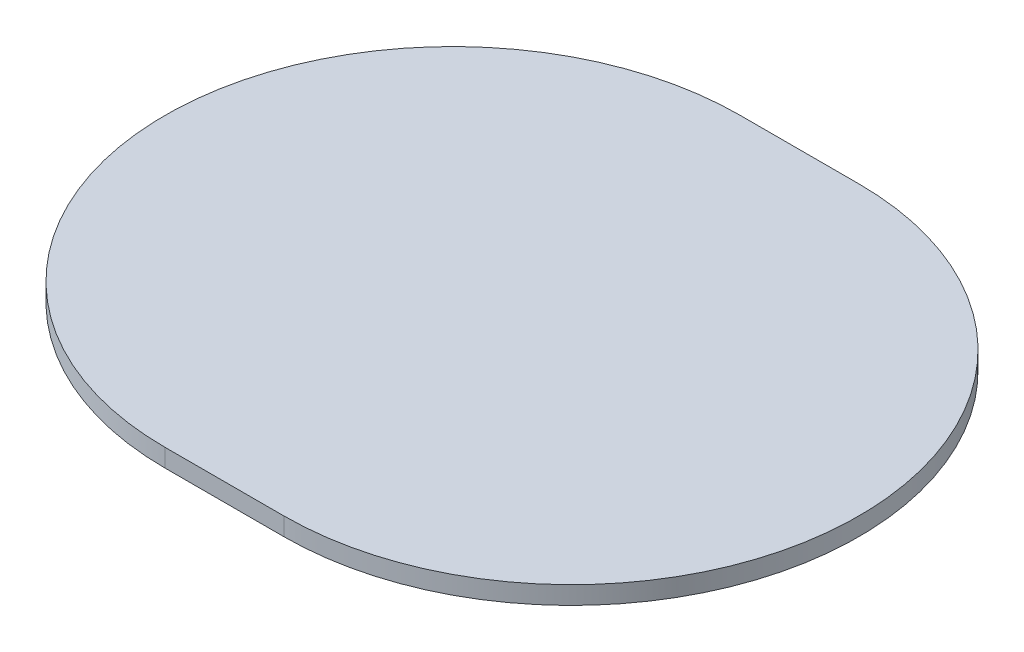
ISO-10303-21;
HEADER;
FILE_DESCRIPTION(('STEP AP214'),'2;1');
FILE_NAME('part.step','',(''),(''),'','','');
FILE_SCHEMA(('AUTOMOTIVE_DESIGN { 1 0 10303 214 1 1 1 1 }'));
ENDSEC;
DATA;
#1=APPLICATION_CONTEXT('core data for automotive mechanical design processes');
#2=APPLICATION_PROTOCOL_DEFINITION('international standard','automotive_design',2000,#1);
#3=PRODUCT_CONTEXT('',#1,'mechanical');
#4=PRODUCT('Part','Part','',(#3));
#5=PRODUCT_RELATED_PRODUCT_CATEGORY('part','',(#4));
#6=PRODUCT_DEFINITION_FORMATION('','',#4);
#7=PRODUCT_DEFINITION_CONTEXT('part definition',#1,'design');
#8=PRODUCT_DEFINITION('design','',#6,#7);
#9=PRODUCT_DEFINITION_SHAPE('','',#8);
#10=(LENGTH_UNIT() NAMED_UNIT(*) SI_UNIT(.MILLI.,.METRE.));
#11=(NAMED_UNIT(*) PLANE_ANGLE_UNIT() SI_UNIT($,.RADIAN.));
#12=(NAMED_UNIT(*) SI_UNIT($,.STERADIAN.) SOLID_ANGLE_UNIT());
#13=UNCERTAINTY_MEASURE_WITH_UNIT(LENGTH_MEASURE(1.E-05),#10,'distance_accuracy_value','');
#14=(GEOMETRIC_REPRESENTATION_CONTEXT(3) GLOBAL_UNCERTAINTY_ASSIGNED_CONTEXT((#13)) GLOBAL_UNIT_ASSIGNED_CONTEXT((#10,
#11,#12)) REPRESENTATION_CONTEXT('',''));
#15=CARTESIAN_POINT('',(0.,0.,0.));
#16=DIRECTION('',(0.,0.,1.));
#17=DIRECTION('',(1.,0.,0.));
#18=AXIS2_PLACEMENT_3D('',#15,#16,#17);
#19=CARTESIAN_POINT('',(133.765,1.001,356.057664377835));
#20=DIRECTION('',(0.,-1.,0.));
#21=DIRECTION('',(0.,0.,-1.));
#22=AXIS2_PLACEMENT_3D('',#19,#20,#21);
#23=CYLINDRICAL_SURFACE('',#22,15.9811770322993);
#24=CARTESIAN_POINT('',(133.765,0.001,356.057664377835));
#25=DIRECTION('',(0.,-1.,0.));
#26=DIRECTION('',(0.,0.,1.));
#27=AXIS2_PLACEMENT_3D('',#24,#25,#26);
#28=CIRCLE('',#27,15.9811770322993);
#29=CARTESIAN_POINT('',(133.765,0.001,372.038841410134));
#30=VERTEX_POINT('',#29);
#31=CARTESIAN_POINT('',(133.765,0.001,340.076487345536));
#32=VERTEX_POINT('',#31);
#33=EDGE_CURVE('E77',#30,#32,#28,.T.);
#34=ORIENTED_EDGE('',*,*,#33,.F.);
#35=DIRECTION('',(0.,-1.,0.));
#36=VECTOR('',#35,1.);
#37=CARTESIAN_POINT('',(133.765,1.001,372.038841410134));
#38=LINE('',#37,#36);
#39=CARTESIAN_POINT('',(133.765,1.001,372.038841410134));
#40=VERTEX_POINT('',#39);
#41=EDGE_CURVE('E30',#40,#30,#38,.T.);
#42=ORIENTED_EDGE('',*,*,#41,.F.);
#43=CARTESIAN_POINT('',(133.765,1.001,356.057664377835));
#44=DIRECTION('',(0.,-1.,0.));
#45=DIRECTION('',(0.,0.,1.));
#46=AXIS2_PLACEMENT_3D('',#43,#44,#45);
#47=CIRCLE('',#46,15.9811770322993);
#48=CARTESIAN_POINT('',(133.765,1.001,340.076487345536));
#49=VERTEX_POINT('',#48);
#50=EDGE_CURVE('E69',#40,#49,#47,.T.);
#51=ORIENTED_EDGE('',*,*,#50,.T.);
#52=DIRECTION('',(0.,-1.,0.));
#53=VECTOR('',#52,1.);
#54=CARTESIAN_POINT('',(133.765,1.001,340.076487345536));
#55=LINE('',#54,#53);
#56=EDGE_CURVE('E9',#49,#32,#55,.T.);
#57=ORIENTED_EDGE('',*,*,#56,.T.);
#58=EDGE_LOOP('',(#34,#42,#51,#57));
#59=FACE_BOUND('',#58,.T.);
#60=ADVANCED_FACE('F14',(#59),#23,.T.);
#61=CARTESIAN_POINT('',(133.765,1.001,340.076487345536));
#62=DIRECTION('',(0.,0.,-1.));
#63=DIRECTION('',(-1.,0.,0.));
#64=AXIS2_PLACEMENT_3D('',#61,#62,#63);
#65=PLANE('',#64);
#66=DIRECTION('',(1.,0.,0.));
#67=VECTOR('',#66,1.);
#68=CARTESIAN_POINT('',(133.765,0.001,340.076487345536));
#69=LINE('',#68,#67);
#70=CARTESIAN_POINT('',(140.369,0.001,340.076487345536));
#71=VERTEX_POINT('',#70);
#72=EDGE_CURVE('E80',#32,#71,#69,.T.);
#73=ORIENTED_EDGE('',*,*,#72,.F.);
#74=ORIENTED_EDGE('',*,*,#56,.F.);
#75=DIRECTION('',(1.,0.,0.));
#76=VECTOR('',#75,1.);
#77=CARTESIAN_POINT('',(133.765,1.001,340.076487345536));
#78=LINE('',#77,#76);
#79=CARTESIAN_POINT('',(140.369,1.001,340.076487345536));
#80=VERTEX_POINT('',#79);
#81=EDGE_CURVE('E65',#49,#80,#78,.T.);
#82=ORIENTED_EDGE('',*,*,#81,.T.);
#83=DIRECTION('',(0.,-1.,0.));
#84=VECTOR('',#83,1.);
#85=CARTESIAN_POINT('',(140.369,1.001,340.076487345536));
#86=LINE('',#85,#84);
#87=EDGE_CURVE('E22',#80,#71,#86,.T.);
#88=ORIENTED_EDGE('',*,*,#87,.T.);
#89=EDGE_LOOP('',(#73,#74,#82,#88));
#90=FACE_BOUND('',#89,.T.);
#91=ADVANCED_FACE('F66',(#90),#65,.T.);
#92=CARTESIAN_POINT('',(140.369,1.001,356.057664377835));
#93=DIRECTION('',(0.,-1.,0.));
#94=DIRECTION('',(0.,0.,-1.));
#95=AXIS2_PLACEMENT_3D('',#92,#93,#94);
#96=CYLINDRICAL_SURFACE('',#95,15.9811770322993);
#97=CARTESIAN_POINT('',(140.369,0.001,356.057664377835));
#98=DIRECTION('',(0.,-1.,0.));
#99=DIRECTION('',(0.,0.,-1.));
#100=AXIS2_PLACEMENT_3D('',#97,#98,#99);
#101=CIRCLE('',#100,15.9811770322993);
#102=CARTESIAN_POINT('',(140.369,0.001,372.038841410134));
#103=VERTEX_POINT('',#102);
#104=EDGE_CURVE('E63',#71,#103,#101,.T.);
#105=ORIENTED_EDGE('',*,*,#104,.F.);
#106=ORIENTED_EDGE('',*,*,#87,.F.);
#107=CARTESIAN_POINT('',(140.369,1.001,356.057664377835));
#108=DIRECTION('',(0.,-1.,0.));
#109=DIRECTION('',(0.,0.,-1.));
#110=AXIS2_PLACEMENT_3D('',#107,#108,#109);
#111=CIRCLE('',#110,15.9811770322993);
#112=CARTESIAN_POINT('',(140.369,1.001,372.038841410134));
#113=VERTEX_POINT('',#112);
#114=EDGE_CURVE('E60',#80,#113,#111,.T.);
#115=ORIENTED_EDGE('',*,*,#114,.T.);
#116=DIRECTION('',(0.,-1.,0.));
#117=VECTOR('',#116,1.);
#118=CARTESIAN_POINT('',(140.369,1.001,372.038841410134));
#119=LINE('',#118,#117);
#120=EDGE_CURVE('E46',#113,#103,#119,.T.);
#121=ORIENTED_EDGE('',*,*,#120,.T.);
#122=EDGE_LOOP('',(#105,#106,#115,#121));
#123=FACE_BOUND('',#122,.T.);
#124=ADVANCED_FACE('F58',(#123),#96,.T.);
#125=CARTESIAN_POINT('',(140.369,1.001,372.038841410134));
#126=DIRECTION('',(0.,0.,1.));
#127=DIRECTION('',(1.,0.,0.));
#128=AXIS2_PLACEMENT_3D('',#125,#126,#127);
#129=PLANE('',#128);
#130=DIRECTION('',(-1.,0.,0.));
#131=VECTOR('',#130,1.);
#132=CARTESIAN_POINT('',(140.369,0.001,372.038841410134));
#133=LINE('',#132,#131);
#134=EDGE_CURVE('E83',#103,#30,#133,.T.);
#135=ORIENTED_EDGE('',*,*,#134,.F.);
#136=ORIENTED_EDGE('',*,*,#120,.F.);
#137=DIRECTION('',(-1.,0.,0.));
#138=VECTOR('',#137,1.);
#139=CARTESIAN_POINT('',(140.369,1.001,372.038841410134));
#140=LINE('',#139,#138);
#141=EDGE_CURVE('E72',#113,#40,#140,.T.);
#142=ORIENTED_EDGE('',*,*,#141,.T.);
#143=ORIENTED_EDGE('',*,*,#41,.T.);
#144=EDGE_LOOP('',(#135,#136,#142,#143));
#145=FACE_BOUND('',#144,.T.);
#146=ADVANCED_FACE('F94',(#145),#129,.T.);
#147=CARTESIAN_POINT('',(137.067,1.001,371.551664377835));
#148=DIRECTION('',(0.,-1.,0.));
#149=DIRECTION('',(1.,0.,0.));
#150=AXIS2_PLACEMENT_3D('',#147,#148,#149);
#151=PLANE('',#150);
#152=ORIENTED_EDGE('',*,*,#50,.F.);
#153=ORIENTED_EDGE('',*,*,#141,.F.);
#154=ORIENTED_EDGE('',*,*,#114,.F.);
#155=ORIENTED_EDGE('',*,*,#81,.F.);
#156=EDGE_LOOP('',(#152,#153,#154,#155));
#157=FACE_BOUND('',#156,.T.);
#158=ADVANCED_FACE('F71',(#157),#151,.F.);
#159=CARTESIAN_POINT('',(137.067,0.001,371.551664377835));
#160=DIRECTION('',(0.,-1.,0.));
#161=DIRECTION('',(1.,0.,0.));
#162=AXIS2_PLACEMENT_3D('',#159,#160,#161);
#163=PLANE('',#162);
#164=ORIENTED_EDGE('',*,*,#33,.T.);
#165=ORIENTED_EDGE('',*,*,#72,.T.);
#166=ORIENTED_EDGE('',*,*,#104,.T.);
#167=ORIENTED_EDGE('',*,*,#134,.T.);
#168=EDGE_LOOP('',(#164,#165,#166,#167));
#169=FACE_BOUND('',#168,.T.);
#170=ADVANCED_FACE('F87',(#169),#163,.T.);
#171=CLOSED_SHELL('',(#60,#91,#124,#146,#158,#170));
#172=MANIFOLD_SOLID_BREP('B1',#171);
#173=ADVANCED_BREP_SHAPE_REPRESENTATION('',(#18,#172),#14);
#174=SHAPE_DEFINITION_REPRESENTATION(#9,#173);
ENDSEC;
END-ISO-10303-21;
